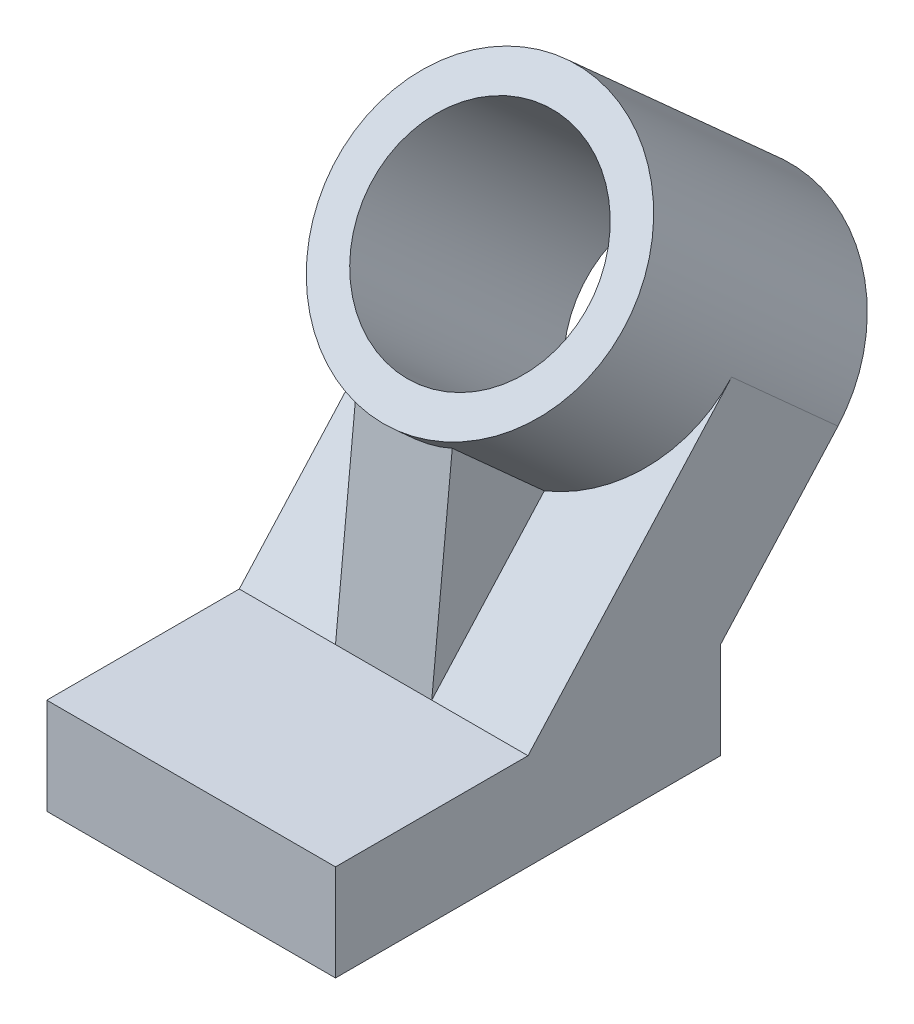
ISO-10303-21;
HEADER;
FILE_DESCRIPTION(('STEP AP214'),'2;1');
FILE_NAME('part.step','',(''),(''),'','','');
FILE_SCHEMA(('AUTOMOTIVE_DESIGN { 1 0 10303 214 1 1 1 1 }'));
ENDSEC;
DATA;
#1=APPLICATION_CONTEXT('core data for automotive mechanical design processes');
#2=APPLICATION_PROTOCOL_DEFINITION('international standard','automotive_design',2000,#1);
#3=PRODUCT_CONTEXT('',#1,'mechanical');
#4=PRODUCT('Part','Part','',(#3));
#5=PRODUCT_RELATED_PRODUCT_CATEGORY('part','',(#4));
#6=PRODUCT_DEFINITION_FORMATION('','',#4);
#7=PRODUCT_DEFINITION_CONTEXT('part definition',#1,'design');
#8=PRODUCT_DEFINITION('design','',#6,#7);
#9=PRODUCT_DEFINITION_SHAPE('','',#8);
#10=(LENGTH_UNIT() NAMED_UNIT(*) SI_UNIT(.MILLI.,.METRE.));
#11=(NAMED_UNIT(*) PLANE_ANGLE_UNIT() SI_UNIT($,.RADIAN.));
#12=(NAMED_UNIT(*) SI_UNIT($,.STERADIAN.) SOLID_ANGLE_UNIT());
#13=UNCERTAINTY_MEASURE_WITH_UNIT(LENGTH_MEASURE(1.E-05),#10,'distance_accuracy_value','');
#14=(GEOMETRIC_REPRESENTATION_CONTEXT(3) GLOBAL_UNCERTAINTY_ASSIGNED_CONTEXT((#13)) GLOBAL_UNIT_ASSIGNED_CONTEXT((#10,
#11,#12)) REPRESENTATION_CONTEXT('',''));
#15=CARTESIAN_POINT('',(0.,0.,0.));
#16=DIRECTION('',(0.,0.,1.));
#17=DIRECTION('',(1.,0.,0.));
#18=AXIS2_PLACEMENT_3D('',#15,#16,#17);
#19=CARTESIAN_POINT('',(38.1,25.4,0.));
#20=DIRECTION('',(0.,-0.669130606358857,-0.743144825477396));
#21=DIRECTION('',(0.,0.743144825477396,-0.669130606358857));
#22=AXIS2_PLACEMENT_3D('',#19,#20,#21);
#23=PLANE('',#22);
#24=DIRECTION('',(0.,-0.743144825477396,0.669130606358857));
#25=VECTOR('',#24,1.);
#26=CARTESIAN_POINT('',(-12.7,25.4,0.));
#27=LINE('',#26,#25);
#28=CARTESIAN_POINT('',(-12.7,58.3860739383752,-29.7007943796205));
#29=VERTEX_POINT('',#28);
#30=CARTESIAN_POINT('',(-12.7,25.4,0.));
#31=VERTEX_POINT('',#30);
#32=EDGE_CURVE('E131',#29,#31,#27,.T.);
#33=ORIENTED_EDGE('',*,*,#32,.F.);
#34=CARTESIAN_POINT('',(0.,85.0805974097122,-53.7366512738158));
#35=DIRECTION('',(0.,0.669130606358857,0.743144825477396));
#36=DIRECTION('',(0.,-0.743144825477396,0.669130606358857));
#37=AXIS2_PLACEMENT_3D('',#34,#35,#36);
#38=CIRCLE('',#37,38.1);
#39=CARTESIAN_POINT('',(-38.1,85.0805974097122,-53.7366512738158));
#40=VERTEX_POINT('',#39);
#41=EDGE_CURVE('E178',#40,#29,#38,.T.);
#42=ORIENTED_EDGE('',*,*,#41,.F.);
#43=DIRECTION('',(0.,-0.743144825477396,0.669130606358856));
#44=VECTOR('',#43,1.);
#45=CARTESIAN_POINT('',(-38.1,25.4,0.));
#46=LINE('',#45,#44);
#47=CARTESIAN_POINT('',(-38.1,25.4,0.));
#48=VERTEX_POINT('',#47);
#49=EDGE_CURVE('E153',#40,#48,#46,.T.);
#50=ORIENTED_EDGE('',*,*,#49,.T.);
#51=DIRECTION('',(-1.,0.,0.));
#52=VECTOR('',#51,1.);
#53=CARTESIAN_POINT('',(38.1,25.4,0.));
#54=LINE('',#53,#52);
#55=EDGE_CURVE('E152',#31,#48,#54,.T.);
#56=ORIENTED_EDGE('',*,*,#55,.F.);
#57=EDGE_LOOP('',(#33,#42,#50,#56));
#58=FACE_BOUND('',#57,.T.);
#59=ADVANCED_FACE('F55',(#58),#23,.F.);
#60=CARTESIAN_POINT('',(12.7,58.3860739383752,-29.7007943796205));
#61=VERTEX_POINT('',#60);
#62=CARTESIAN_POINT('',(38.1,85.0805974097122,-53.7366512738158));
#63=VERTEX_POINT('',#62);
#64=EDGE_CURVE('E174',#61,#63,#38,.T.);
#65=ORIENTED_EDGE('',*,*,#64,.F.);
#66=DIRECTION('',(0.,-0.743144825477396,0.669130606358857));
#67=VECTOR('',#66,1.);
#68=CARTESIAN_POINT('',(12.7,25.4,0.));
#69=LINE('',#68,#67);
#70=CARTESIAN_POINT('',(12.7,25.4,0.));
#71=VERTEX_POINT('',#70);
#72=EDGE_CURVE('E168',#61,#71,#69,.T.);
#73=ORIENTED_EDGE('',*,*,#72,.T.);
#74=CARTESIAN_POINT('',(38.1,25.4,0.));
#75=VERTEX_POINT('',#74);
#76=EDGE_CURVE('E156',#75,#71,#54,.T.);
#77=ORIENTED_EDGE('',*,*,#76,.F.);
#78=DIRECTION('',(0.,-0.743144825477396,0.669130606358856));
#79=VECTOR('',#78,1.);
#80=CARTESIAN_POINT('',(38.1,25.4,0.));
#81=LINE('',#80,#79);
#82=EDGE_CURVE('E193',#63,#75,#81,.T.);
#83=ORIENTED_EDGE('',*,*,#82,.F.);
#84=EDGE_LOOP('',(#65,#73,#77,#83));
#85=FACE_BOUND('',#84,.T.);
#86=ADVANCED_FACE('F245',(#85),#23,.F.);
#87=CARTESIAN_POINT('',(38.1,25.4,-50.8));
#88=DIRECTION('',(0.,0.669130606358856,0.743144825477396));
#89=DIRECTION('',(0.,-0.743144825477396,0.669130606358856));
#90=AXIS2_PLACEMENT_3D('',#87,#88,#89);
#91=PLANE('',#90);
#92=CARTESIAN_POINT('',(0.,59.8197412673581,-81.7916742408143));
#93=DIRECTION('',(0.,0.669130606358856,0.743144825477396));
#94=DIRECTION('',(0.,-0.743144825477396,0.669130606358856));
#95=AXIS2_PLACEMENT_3D('',#92,#93,#94);
#96=CIRCLE('',#95,28.575);
#97=CARTESIAN_POINT('',(0.,38.5843778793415,-62.67126716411));
#98=VERTEX_POINT('',#97);
#99=EDGE_CURVE('E166',#98,#98,#96,.F.);
#100=ORIENTED_EDGE('',*,*,#99,.F.);
#101=EDGE_LOOP('',(#100));
#102=FACE_BOUND('',#101,.T.);
#103=DIRECTION('',(-1.,0.,0.));
#104=VECTOR('',#103,1.);
#105=CARTESIAN_POINT('',(38.1,25.4,-50.8));
#106=LINE('',#105,#104);
#107=CARTESIAN_POINT('',(38.1,25.4,-50.8));
#108=VERTEX_POINT('',#107);
#109=CARTESIAN_POINT('',(-38.1,25.4,-50.8));
#110=VERTEX_POINT('',#109);
#111=EDGE_CURVE('E212',#108,#110,#106,.T.);
#112=ORIENTED_EDGE('',*,*,#111,.T.);
#113=DIRECTION('',(0.,0.743144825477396,-0.669130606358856));
#114=VECTOR('',#113,1.);
#115=CARTESIAN_POINT('',(-38.1,25.4,-50.8));
#116=LINE('',#115,#114);
#117=CARTESIAN_POINT('',(-38.1,59.8197412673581,-81.7916742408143));
#118=VERTEX_POINT('',#117);
#119=EDGE_CURVE('E205',#110,#118,#116,.T.);
#120=ORIENTED_EDGE('',*,*,#119,.T.);
#121=CARTESIAN_POINT('',(0.,59.8197412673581,-81.7916742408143));
#122=DIRECTION('',(0.,0.669130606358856,0.743144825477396));
#123=DIRECTION('',(0.,-0.743144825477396,0.669130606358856));
#124=AXIS2_PLACEMENT_3D('',#121,#122,#123);
#125=CIRCLE('',#124,38.1);
#126=CARTESIAN_POINT('',(38.1,59.8197412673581,-81.7916742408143));
#127=VERTEX_POINT('',#126);
#128=EDGE_CURVE('E78',#127,#118,#125,.T.);
#129=ORIENTED_EDGE('',*,*,#128,.F.);
#130=DIRECTION('',(0.,0.743144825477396,-0.669130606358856));
#131=VECTOR('',#130,1.);
#132=CARTESIAN_POINT('',(38.1,25.4,-50.8));
#133=LINE('',#132,#131);
#134=EDGE_CURVE('E190',#108,#127,#133,.T.);
#135=ORIENTED_EDGE('',*,*,#134,.F.);
#136=EDGE_LOOP('',(#112,#120,#129,#135));
#137=FACE_BOUND('',#136,.T.);
#138=ADVANCED_FACE('F225',(#102,#137),#91,.F.);
#139=CARTESIAN_POINT('',(38.1,0.,50.8));
#140=DIRECTION('',(0.,0.,-1.));
#141=DIRECTION('',(-1.,0.,0.));
#142=AXIS2_PLACEMENT_3D('',#139,#140,#141);
#143=PLANE('',#142);
#144=DIRECTION('',(0.,-1.,0.));
#145=VECTOR('',#144,1.);
#146=CARTESIAN_POINT('',(-38.1,0.,50.8));
#147=LINE('',#146,#145);
#148=CARTESIAN_POINT('',(-38.1,25.4,50.8));
#149=VERTEX_POINT('',#148);
#150=CARTESIAN_POINT('',(-38.1,0.,50.8));
#151=VERTEX_POINT('',#150);
#152=EDGE_CURVE('E181',#149,#151,#147,.T.);
#153=ORIENTED_EDGE('',*,*,#152,.T.);
#154=DIRECTION('',(-1.,0.,0.));
#155=VECTOR('',#154,1.);
#156=CARTESIAN_POINT('',(38.1,0.,50.8));
#157=LINE('',#156,#155);
#158=CARTESIAN_POINT('',(38.1,0.,50.8));
#159=VERTEX_POINT('',#158);
#160=EDGE_CURVE('E216',#159,#151,#157,.T.);
#161=ORIENTED_EDGE('',*,*,#160,.F.);
#162=DIRECTION('',(0.,-1.,0.));
#163=VECTOR('',#162,1.);
#164=CARTESIAN_POINT('',(38.1,0.,50.8));
#165=LINE('',#164,#163);
#166=CARTESIAN_POINT('',(38.1,25.4,50.8));
#167=VERTEX_POINT('',#166);
#168=EDGE_CURVE('E182',#167,#159,#165,.T.);
#169=ORIENTED_EDGE('',*,*,#168,.F.);
#170=DIRECTION('',(-1.,0.,0.));
#171=VECTOR('',#170,1.);
#172=CARTESIAN_POINT('',(38.1,25.4,50.8));
#173=LINE('',#172,#171);
#174=EDGE_CURVE('E157',#167,#149,#173,.T.);
#175=ORIENTED_EDGE('',*,*,#174,.T.);
#176=EDGE_LOOP('',(#153,#161,#169,#175));
#177=FACE_BOUND('',#176,.T.);
#178=ADVANCED_FACE('F57',(#177),#143,.F.);
#179=CARTESIAN_POINT('',(38.1,0.,50.8));
#180=DIRECTION('',(0.,1.,0.));
#181=DIRECTION('',(0.,0.,1.));
#182=AXIS2_PLACEMENT_3D('',#179,#180,#181);
#183=PLANE('',#182);
#184=DIRECTION('',(0.,0.,-1.));
#185=VECTOR('',#184,1.);
#186=CARTESIAN_POINT('',(-38.1,0.,50.8));
#187=LINE('',#186,#185);
#188=CARTESIAN_POINT('',(-38.1,0.,-50.8));
#189=VERTEX_POINT('',#188);
#190=EDGE_CURVE('E199',#151,#189,#187,.T.);
#191=ORIENTED_EDGE('',*,*,#190,.T.);
#192=DIRECTION('',(-1.,0.,0.));
#193=VECTOR('',#192,1.);
#194=CARTESIAN_POINT('',(38.1,0.,-50.8));
#195=LINE('',#194,#193);
#196=CARTESIAN_POINT('',(38.1,0.,-50.8));
#197=VERTEX_POINT('',#196);
#198=EDGE_CURVE('E214',#197,#189,#195,.T.);
#199=ORIENTED_EDGE('',*,*,#198,.F.);
#200=DIRECTION('',(0.,0.,-1.));
#201=VECTOR('',#200,1.);
#202=CARTESIAN_POINT('',(38.1,0.,50.8));
#203=LINE('',#202,#201);
#204=EDGE_CURVE('E185',#159,#197,#203,.T.);
#205=ORIENTED_EDGE('',*,*,#204,.F.);
#206=ORIENTED_EDGE('',*,*,#160,.T.);
#207=EDGE_LOOP('',(#191,#199,#205,#206));
#208=FACE_BOUND('',#207,.T.);
#209=ADVANCED_FACE('F235',(#208),#183,.F.);
#210=CARTESIAN_POINT('',(38.1,0.,-50.8));
#211=DIRECTION('',(0.,0.,1.));
#212=DIRECTION('',(1.,0.,0.));
#213=AXIS2_PLACEMENT_3D('',#210,#211,#212);
#214=PLANE('',#213);
#215=ORIENTED_EDGE('',*,*,#198,.T.);
#216=DIRECTION('',(0.,1.,0.));
#217=VECTOR('',#216,1.);
#218=CARTESIAN_POINT('',(-38.1,0.,-50.8));
#219=LINE('',#218,#217);
#220=EDGE_CURVE('E202',#189,#110,#219,.T.);
#221=ORIENTED_EDGE('',*,*,#220,.T.);
#222=ORIENTED_EDGE('',*,*,#111,.F.);
#223=DIRECTION('',(0.,1.,0.));
#224=VECTOR('',#223,1.);
#225=CARTESIAN_POINT('',(38.1,0.,-50.8));
#226=LINE('',#225,#224);
#227=EDGE_CURVE('E188',#197,#108,#226,.T.);
#228=ORIENTED_EDGE('',*,*,#227,.F.);
#229=EDGE_LOOP('',(#215,#221,#222,#228));
#230=FACE_BOUND('',#229,.T.);
#231=ADVANCED_FACE('F230',(#230),#214,.F.);
#232=CARTESIAN_POINT('',(38.1,25.4,50.8));
#233=DIRECTION('',(0.,-1.,0.));
#234=DIRECTION('',(0.,0.,-1.));
#235=AXIS2_PLACEMENT_3D('',#232,#233,#234);
#236=PLANE('',#235);
#237=DIRECTION('',(0.,0.,1.));
#238=VECTOR('',#237,1.);
#239=CARTESIAN_POINT('',(-38.1,25.4,50.8));
#240=LINE('',#239,#238);
#241=EDGE_CURVE('E186',#48,#149,#240,.T.);
#242=ORIENTED_EDGE('',*,*,#241,.T.);
#243=ORIENTED_EDGE('',*,*,#174,.F.);
#244=DIRECTION('',(0.,0.,1.));
#245=VECTOR('',#244,1.);
#246=CARTESIAN_POINT('',(38.1,25.4,50.8));
#247=LINE('',#246,#245);
#248=EDGE_CURVE('E195',#75,#167,#247,.T.);
#249=ORIENTED_EDGE('',*,*,#248,.F.);
#250=ORIENTED_EDGE('',*,*,#76,.T.);
#251=DIRECTION('',(-1.,0.,0.));
#252=VECTOR('',#251,1.);
#253=CARTESIAN_POINT('',(38.1,25.4,0.));
#254=LINE('',#253,#252);
#255=EDGE_CURVE('E145',#71,#31,#254,.T.);
#256=ORIENTED_EDGE('',*,*,#255,.T.);
#257=ORIENTED_EDGE('',*,*,#55,.T.);
#258=EDGE_LOOP('',(#242,#243,#249,#250,#256,#257));
#259=FACE_BOUND('',#258,.T.);
#260=ADVANCED_FACE('F160',(#259),#236,.F.);
#261=CARTESIAN_POINT('',(38.1,0.,0.));
#262=DIRECTION('',(-1.,0.,0.));
#263=DIRECTION('',(0.,0.,1.));
#264=AXIS2_PLACEMENT_3D('',#261,#262,#263);
#265=PLANE('',#264);
#266=ORIENTED_EDGE('',*,*,#134,.T.);
#267=DIRECTION('',(0.,0.669130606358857,0.743144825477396));
#268=VECTOR('',#267,1.);
#269=CARTESIAN_POINT('',(38.1,59.5867213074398,-82.0504691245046));
#270=LINE('',#269,#268);
#271=EDGE_CURVE('E12',#127,#63,#270,.T.);
#272=ORIENTED_EDGE('',*,*,#271,.T.);
#273=ORIENTED_EDGE('',*,*,#82,.T.);
#274=ORIENTED_EDGE('',*,*,#248,.T.);
#275=ORIENTED_EDGE('',*,*,#168,.T.);
#276=ORIENTED_EDGE('',*,*,#204,.T.);
#277=ORIENTED_EDGE('',*,*,#227,.T.);
#278=EDGE_LOOP('',(#266,#272,#273,#274,#275,#276,#277));
#279=FACE_BOUND('',#278,.T.);
#280=ADVANCED_FACE('F240',(#279),#265,.F.);
#281=CARTESIAN_POINT('',(-38.1,0.,0.));
#282=DIRECTION('',(-1.,0.,0.));
#283=DIRECTION('',(0.,0.,1.));
#284=AXIS2_PLACEMENT_3D('',#281,#282,#283);
#285=PLANE('',#284);
#286=DIRECTION('',(0.,0.669130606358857,0.743144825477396));
#287=VECTOR('',#286,1.);
#288=CARTESIAN_POINT('',(-38.1,59.5867213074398,-82.0504691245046));
#289=LINE('',#288,#287);
#290=EDGE_CURVE('E63',#118,#40,#289,.T.);
#291=ORIENTED_EDGE('',*,*,#290,.F.);
#292=ORIENTED_EDGE('',*,*,#119,.F.);
#293=ORIENTED_EDGE('',*,*,#220,.F.);
#294=ORIENTED_EDGE('',*,*,#190,.F.);
#295=ORIENTED_EDGE('',*,*,#152,.F.);
#296=ORIENTED_EDGE('',*,*,#241,.F.);
#297=ORIENTED_EDGE('',*,*,#49,.F.);
#298=EDGE_LOOP('',(#291,#292,#293,#294,#295,#296,#297));
#299=FACE_BOUND('',#298,.T.);
#300=ADVANCED_FACE('F222',(#299),#285,.T.);
#301=CARTESIAN_POINT('',(0.,59.5867213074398,-82.0504691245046));
#302=DIRECTION('',(0.,0.669130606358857,0.743144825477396));
#303=DIRECTION('',(0.,-0.743144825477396,0.669130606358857));
#304=AXIS2_PLACEMENT_3D('',#301,#302,#303);
#305=CYLINDRICAL_SURFACE('',#304,38.1);
#306=ORIENTED_EDGE('',*,*,#128,.T.);
#307=ORIENTED_EDGE('',*,*,#290,.T.);
#308=ORIENTED_EDGE('',*,*,#41,.T.);
#309=DIRECTION('',(0.,0.669130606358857,0.743144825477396));
#310=VECTOR('',#309,1.);
#311=CARTESIAN_POINT('',(-12.7,32.8921978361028,-58.0146122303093));
#312=LINE('',#311,#310);
#313=CARTESIAN_POINT('',(-12.7,80.2598615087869,-5.40749215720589));
#314=VERTEX_POINT('',#313);
#315=EDGE_CURVE('E134',#29,#314,#312,.T.);
#316=ORIENTED_EDGE('',*,*,#315,.T.);
#317=CARTESIAN_POINT('',(0.,124.656107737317,-9.78359422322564));
#318=DIRECTION('',(0.,0.098093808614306,0.995177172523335));
#319=DIRECTION('',(0.,0.995177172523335,-0.098093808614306));
#320=AXIS2_PLACEMENT_3D('',#317,#318,#319);
#321=ELLIPSE('',#320,47.3175344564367,38.1);
#322=CARTESIAN_POINT('',(12.7,80.2598615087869,-5.4074921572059));
#323=VERTEX_POINT('',#322);
#324=EDGE_CURVE('E148',#323,#314,#321,.F.);
#325=ORIENTED_EDGE('',*,*,#324,.F.);
#326=DIRECTION('',(0.,0.669130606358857,0.743144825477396));
#327=VECTOR('',#326,1.);
#328=CARTESIAN_POINT('',(12.7,32.8921978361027,-58.0146122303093));
#329=LINE('',#328,#327);
#330=EDGE_CURVE('E139',#61,#323,#329,.T.);
#331=ORIENTED_EDGE('',*,*,#330,.F.);
#332=ORIENTED_EDGE('',*,*,#64,.T.);
#333=ORIENTED_EDGE('',*,*,#271,.F.);
#334=EDGE_LOOP('',(#306,#307,#308,#316,#325,#331,#332,#333));
#335=FACE_BOUND('',#334,.T.);
#336=CARTESIAN_POINT('',(0.,110.574473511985,-25.422833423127));
#337=DIRECTION('',(0.,0.669130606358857,0.743144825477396));
#338=DIRECTION('',(0.,-0.743144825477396,0.669130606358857));
#339=AXIS2_PLACEMENT_3D('',#336,#337,#338);
#340=CIRCLE('',#339,38.1);
#341=CARTESIAN_POINT('',(0.,82.2606556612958,0.0710426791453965));
#342=VERTEX_POINT('',#341);
#343=EDGE_CURVE('E175',#342,#342,#340,.T.);
#344=ORIENTED_EDGE('',*,*,#343,.F.);
#345=EDGE_LOOP('',(#344));
#346=FACE_BOUND('',#345,.T.);
#347=ADVANCED_FACE('F218',(#335,#346),#305,.T.);
#348=CARTESIAN_POINT('',(0.,110.574473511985,-25.422833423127));
#349=DIRECTION('',(0.,0.669130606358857,0.743144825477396));
#350=DIRECTION('',(0.,-0.743144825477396,0.669130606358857));
#351=AXIS2_PLACEMENT_3D('',#348,#349,#350);
#352=PLANE('',#351);
#353=CARTESIAN_POINT('',(0.,110.574473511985,-25.4228334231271));
#354=DIRECTION('',(0.,0.669130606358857,0.743144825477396));
#355=DIRECTION('',(0.,-0.743144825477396,0.669130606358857));
#356=AXIS2_PLACEMENT_3D('',#353,#354,#355);
#357=CIRCLE('',#356,28.575);
#358=CARTESIAN_POINT('',(0.,89.339110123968,-6.30242634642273));
#359=VERTEX_POINT('',#358);
#360=EDGE_CURVE('E163',#359,#359,#357,.T.);
#361=ORIENTED_EDGE('',*,*,#360,.F.);
#362=EDGE_LOOP('',(#361));
#363=FACE_BOUND('',#362,.T.);
#364=ORIENTED_EDGE('',*,*,#343,.T.);
#365=EDGE_LOOP('',(#364));
#366=FACE_BOUND('',#365,.T.);
#367=ADVANCED_FACE('F320',(#363,#366),#352,.T.);
#368=CARTESIAN_POINT('',(0.,20.3582494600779,-125.618100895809));
#369=DIRECTION('',(0.,0.669130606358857,0.743144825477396));
#370=DIRECTION('',(0.,-0.743144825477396,0.669130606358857));
#371=AXIS2_PLACEMENT_3D('',#368,#369,#370);
#372=CYLINDRICAL_SURFACE('',#371,28.575);
#373=ORIENTED_EDGE('',*,*,#99,.T.);
#374=EDGE_LOOP('',(#373));
#375=FACE_BOUND('',#374,.T.);
#376=ORIENTED_EDGE('',*,*,#360,.T.);
#377=EDGE_LOOP('',(#376));
#378=FACE_BOUND('',#377,.T.);
#379=ADVANCED_FACE('F259',(#375,#378),#372,.F.);
#380=CARTESIAN_POINT('',(0.,89.339110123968,-6.30242634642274));
#381=DIRECTION('',(0.,0.098093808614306,0.995177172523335));
#382=DIRECTION('',(0.,-0.995177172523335,0.098093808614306));
#383=AXIS2_PLACEMENT_3D('',#380,#381,#382);
#384=PLANE('',#383);
#385=ORIENTED_EDGE('',*,*,#255,.F.);
#386=DIRECTION('',(0.,-0.995177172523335,0.098093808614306));
#387=VECTOR('',#386,1.);
#388=CARTESIAN_POINT('',(12.7,89.339110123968,-6.30242634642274));
#389=LINE('',#388,#387);
#390=EDGE_CURVE('E149',#323,#71,#389,.T.);
#391=ORIENTED_EDGE('',*,*,#390,.F.);
#392=ORIENTED_EDGE('',*,*,#324,.T.);
#393=DIRECTION('',(0.,-0.995177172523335,0.098093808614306));
#394=VECTOR('',#393,1.);
#395=CARTESIAN_POINT('',(-12.7,89.339110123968,-6.30242634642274));
#396=LINE('',#395,#394);
#397=EDGE_CURVE('E70',#314,#31,#396,.T.);
#398=ORIENTED_EDGE('',*,*,#397,.T.);
#399=EDGE_LOOP('',(#385,#391,#392,#398));
#400=FACE_BOUND('',#399,.T.);
#401=ADVANCED_FACE('F142',(#400),#384,.T.);
#402=CARTESIAN_POINT('',(12.7,69.4441456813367,-28.2427751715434));
#403=DIRECTION('',(1.,0.,0.));
#404=DIRECTION('',(0.,0.,-1.));
#405=AXIS2_PLACEMENT_3D('',#402,#403,#404);
#406=PLANE('',#405);
#407=ORIENTED_EDGE('',*,*,#72,.F.);
#408=ORIENTED_EDGE('',*,*,#330,.T.);
#409=ORIENTED_EDGE('',*,*,#390,.T.);
#410=EDGE_LOOP('',(#407,#408,#409));
#411=FACE_BOUND('',#410,.T.);
#412=ADVANCED_FACE('F251',(#411),#406,.T.);
#413=CARTESIAN_POINT('',(-12.7,69.4441456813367,-28.2427751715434));
#414=DIRECTION('',(1.,0.,0.));
#415=DIRECTION('',(0.,0.,-1.));
#416=AXIS2_PLACEMENT_3D('',#413,#414,#415);
#417=PLANE('',#416);
#418=ORIENTED_EDGE('',*,*,#315,.F.);
#419=ORIENTED_EDGE('',*,*,#32,.T.);
#420=ORIENTED_EDGE('',*,*,#397,.F.);
#421=EDGE_LOOP('',(#418,#419,#420));
#422=FACE_BOUND('',#421,.T.);
#423=ADVANCED_FACE('F132',(#422),#417,.F.);
#424=CLOSED_SHELL('',(#59,#86,#138,#178,#209,#231,#260,#280,#300,#347,#367,#379,#401,#412,#423));
#425=MANIFOLD_SOLID_BREP('B2',#424);
#426=ADVANCED_BREP_SHAPE_REPRESENTATION('',(#18,#425),#14);
#427=SHAPE_DEFINITION_REPRESENTATION(#9,#426);
ENDSEC;
END-ISO-10303-21;
